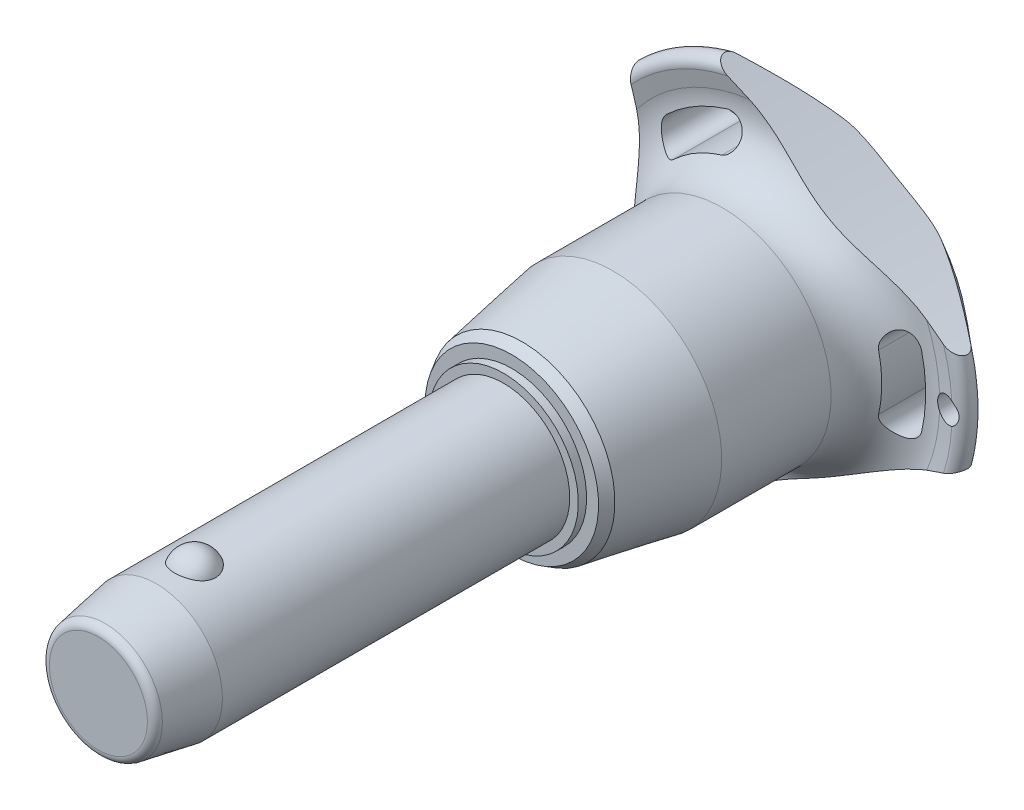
from build123d import *

# Parameters (mm, degrees)
SKETCH1_R           = 8
BOSS_EXTRUDE1_DEPTH = 35
SKETCH2_R           = 7
BOSS_EXTRUDE2_DEPTH = 39.7
BOSS_EXTRUDE3_START = 14
SKETCH1_2_R         = 8
BOSS_EXTRUDE3_DEPTH = 14
CHAMFER1_SIZE       = 7
CHAMFER1_SIZE2      = 1.234288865
FILLET1_R           = 1
SKETCH6_R           = 144.275
CUT_EXTRUDE1_DEPTH  = 82.935434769
CIRPATTERN1_COUNT   = 3
SKETCH7_R           = 1.5
CUT_EXTRUDE2_DEPTH  = 82.690131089


with BuildPart() as part:
    # Sketch1 → Boss-Extrude1 (new body)
    with BuildSketch(Plane.XY):
        Circle(SKETCH1_R)
    extrude(amount=-BOSS_EXTRUDE1_DEPTH)

    # Sketch2 → Boss-Extrude2 (add)
    with BuildSketch(Plane(origin=(0, 0, -35), x_dir=(-1, 0, 0), z_dir=(0, 0, -1))):
        Circle(SKETCH2_R)
    extrude(amount=BOSS_EXTRUDE2_DEPTH)

    # Sketch3 → Revolve1 (revolve)
    with BuildSketch(Plane(origin=(0, 0, 0), x_dir=(0, 0, -1), z_dir=(1, 0, 0))):
        with BuildLine():
            Line((-2.387467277, 9.5), (-2.387467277, 4.2))
            ThreePointArc((-2.387467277, 4.2), (0.262532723, 6.85), (-2.387467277, 9.5))
        make_face()
        with BuildLine():
            Line((-2.387467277, -4.2), (-2.387467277, -9.5))
            ThreePointArc((-2.387467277, -9.5), (0.262532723, -6.85), (-2.387467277, -4.2))
        make_face()
    revolve(axis=Axis((0, -4.2, 2.387467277), (0, 1, 0)))

    # Sketch1_2 → Boss-Extrude3 (add)
    with BuildSketch(Plane.XY.offset(BOSS_EXTRUDE3_START)):
        Circle(SKETCH1_2_R)
    extrude(amount=-BOSS_EXTRUDE3_DEPTH)

    # Chamfer1
    chamfer1_edges = [part.edges().sort_by_distance(p)[0] for p in [
        (-8, 0, 14),
    ]]
    chamfer1_side = [part.faces().sort_by_distance(p)[0] for p in [
        (-8, 0, -10.5),
    ]]
    chamfer(chamfer1_edges, length=CHAMFER1_SIZE, length2=CHAMFER1_SIZE2, reference=chamfer1_side[0])

    # Fillet1
    fillet1_edges = [part.edges().sort_by_distance(p)[0] for p in [
        (-6.765711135, 0, 14),
        (7, 0, -74.7),
    ]]
    fillet(fillet1_edges, radius=FILLET1_R)

    # Sketch4 → Revolve2 (revolve)
    with BuildSketch(Plane(origin=(0, 0, 0), x_dir=(0, 0, -1), z_dir=(1, 0, 0)), mode=Mode.PRIVATE) as revolve2_sk:
        Polygon((35, 0), (35, 9.044607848), (36, 9.044607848), (36, 10.490707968), (37.25235944, 11.213758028), (48.233333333, 13.15), (61.466666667, 13.15), (61.466666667, 0), align=None)
    revolve(revolve2_sk.sketch.rotate(Axis((0, 0, -61.466666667), (0, 0, 1)), 90), axis=Axis((0, 0, -61.466666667), (0, 0, 1)))

    # Sketch5 → Revolve3 (revolve)
    with BuildSketch(Plane(origin=(0, 0, 0), x_dir=(0, 0, -1), z_dir=(1, 0, 0)), mode=Mode.PRIVATE) as revolve3_sk:
        with BuildLine():
            Line((67.32877039, 20.428960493), (66.910912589, 22.344207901))
            ThreePointArc((66.910912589, 22.344207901), (67.554394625, 23.677136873), (69.002586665, 23.371345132))
            Line((69.002586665, 23.371345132), (74.141488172, 17.247040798))
            ThreePointArc((74.141488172, 17.247040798), (74.7, 15.584758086), (73.978803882, 13.986322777))
            ThreePointArc((73.978803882, 13.986322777), (69.617427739, 7.589034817), (68.083333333, 0))
            Line((68.083333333, 0), (61.466666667, 0))
            Line((61.466666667, 0), (61.466666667, 13.15))
            ThreePointArc((61.466666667, 13.15), (66.139661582, 15.38660811), (67.32877039, 20.428960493))
        make_face()
    revolve(revolve3_sk.sketch.rotate(Axis((0, 0, -68.083333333), (0, 0, 1)), 90), axis=Axis((0, 0, -68.083333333), (0, 0, 1)))

    # Sketch6 → Cut-Extrude1 (cut, through all)
    with BuildSketch(Plane.XY):
        with Locations((-159.975, 0)):
            Circle(SKETCH6_R)
        with BuildLine():
            ThreePointArc((18.131206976, -4.190753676), (18.60922037, 0), (18.131206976, 4.190753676))
            ThreePointArc((18.131206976, 4.190753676), (15.94840906, 5.553949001), (14.585213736, 3.371151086))
            ThreePointArc((14.585213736, 3.371151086), (14.969740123, 0), (14.585213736, -3.371151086))
            ThreePointArc((14.585213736, -3.371151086), (15.94840906, -5.553949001), (18.131206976, -4.190753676))
        make_face()
    cut_extrude1 = extrude(amount=-CUT_EXTRUDE1_DEPTH, mode=Mode.SUBTRACT)

    # CirPattern1: Cut-Extrude1 ×3 about axis
    cirpattern1_axis = Axis((0, 0, 0), (0, 0, 1))
    for i in range(1, CIRPATTERN1_COUNT):
        add(cut_extrude1.rotate(cirpattern1_axis, i * 360 / CIRPATTERN1_COUNT), mode=Mode.SUBTRACT)

    # Sketch7 → Cut-Extrude2 (cut, through all)
    with BuildSketch(Plane.XY):
        with Locations(Location((21.60922037, 0, 0), (0, 0, 297.620773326))):
            Circle(SKETCH7_R)
    extrude(amount=-CUT_EXTRUDE2_DEPTH, mode=Mode.SUBTRACT)


solid = part.part
